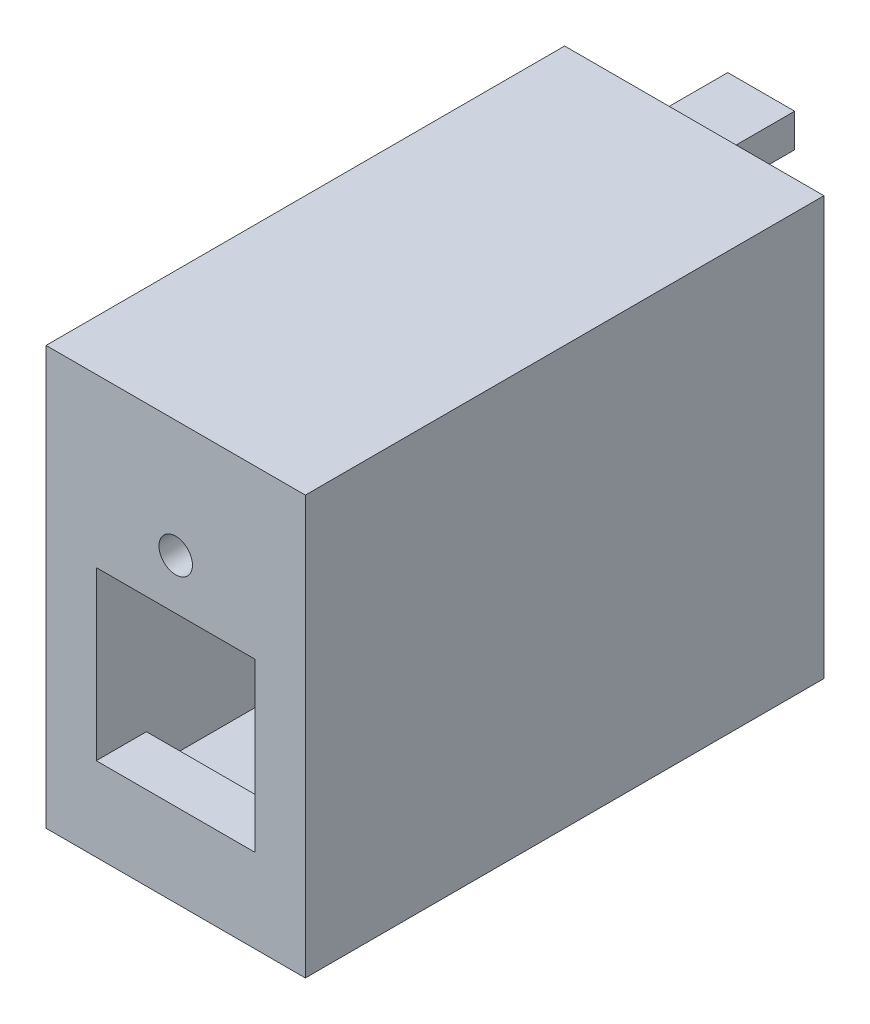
from build123d import *

# Parameters (mm, degrees)
SKETCH1_W           = 15.5
SKETCH1_H           = 25
BOSS_EXTRUDE1_DEPTH = 31
SHELL1_T            = -3
CUT_EXTRUDE1_REACH  = 109.812
SKETCH2_W           = 9.5
SKETCH2_H           = 10
CUT_EXTRUDE2_REACH  = 109.812
SKETCH3_R           = 1
SKETCH4_W           = 4
SKETCH4_H           = 2
BOSS_EXTRUDE2_DEPTH = 4


with BuildPart() as part:
    # Sketch1 → Boss-Extrude1 (new body)
    with BuildSketch(Plane.XY):
        with Locations((94.75, 0)):
            Rectangle(SKETCH1_W, SKETCH1_H)
    extrude(amount=BOSS_EXTRUDE1_DEPTH)

    # Shell1
    shell1_openings = [part.faces().sort_by_distance(p)[0] for p in [
        (94.75, 0, 0),
    ]]
    offset(amount=SHELL1_T, openings=shell1_openings, kind=Kind.INTERSECTION)

    # Sketch2 → Cut-Extrude1 (cut, up to next)
    with BuildSketch(Plane.XY.offset(31), mode=Mode.PRIVATE) as cut_extrude1_sk1:
        with Locations((94.75, -2.5)):
            Rectangle(SKETCH2_W, SKETCH2_H)
    cut_extrude1_tool1 = extrude(cut_extrude1_sk1.sketch, amount=-CUT_EXTRUDE1_REACH, mode=Mode.PRIVATE) & part.part
    add(cut_extrude1_tool1.solids().sort_by_distance((94.75, -2.5, 31))[0], mode=Mode.SUBTRACT)

    # Sketch3 → Cut-Extrude2 (cut, up to next)
    with BuildSketch(Plane.XY.offset(31), mode=Mode.PRIVATE) as cut_extrude2_sk1:
        with Locations((94.75, 5.5)):
            Circle(SKETCH3_R)
    cut_extrude2_tool1 = extrude(cut_extrude2_sk1.sketch, amount=-CUT_EXTRUDE2_REACH, mode=Mode.PRIVATE) & part.part
    add(cut_extrude2_tool1.solids().sort_by_distance((94.75, 5.5, 31))[0], mode=Mode.SUBTRACT)

    # Sketch4 → Boss-Extrude2 (add)
    with BuildSketch(Plane(origin=(0, 0, 0), x_dir=(-1, 0, 0), z_dir=(0, 0, -1))):
        with Locations((-94.75, 11)):
            Rectangle(SKETCH4_W, SKETCH4_H)
    boss_extrude2 = extrude(amount=BOSS_EXTRUDE2_DEPTH)

    # Mirror1: Boss-Extrude2 across plane
    add(boss_extrude2.mirror(Plane.ZX))


solid = part.part
